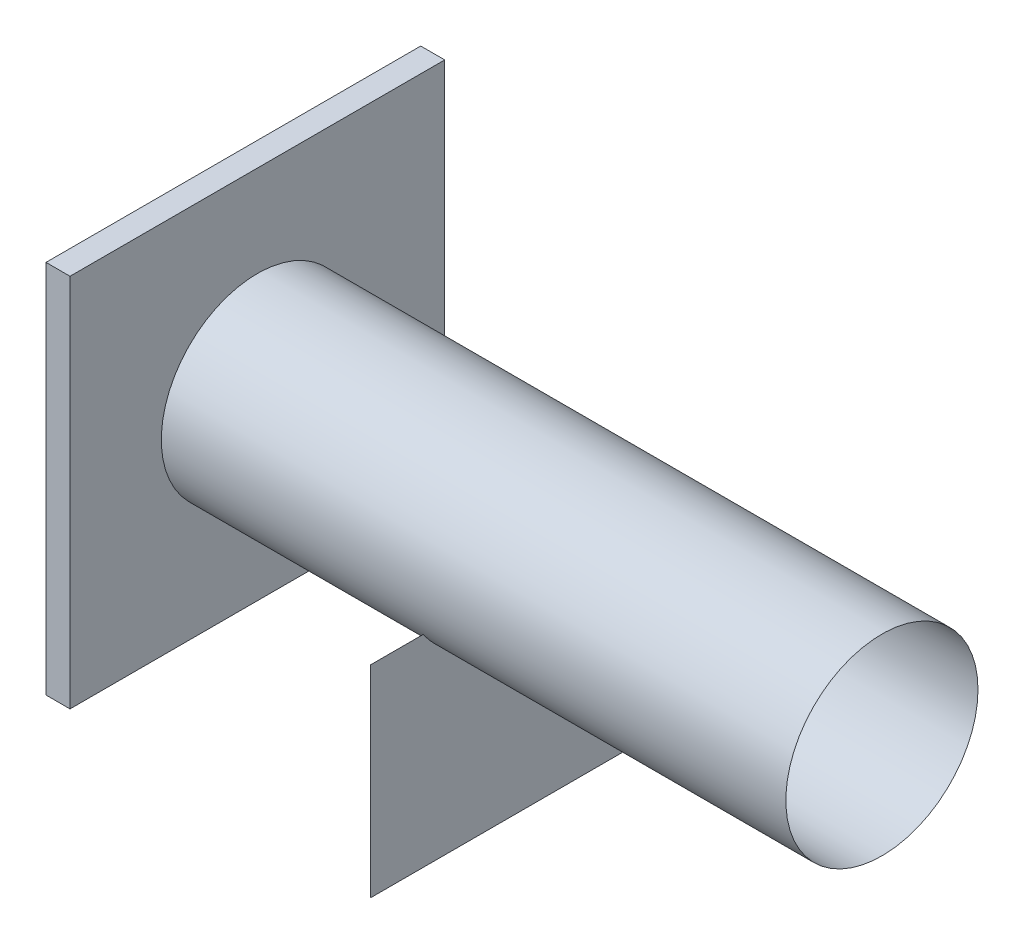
from build123d import *

# Parameters (mm, degrees)
SKETCH4_W           = 780
SKETCH4_H           = 780
SKETCH4_R           = 190
BOSS_EXTRUDE1_DEPTH = 50


with BuildPart() as part:
    # Sketch4 → Boss-Extrude1 (new body)
    with BuildSketch(Plane(origin=(0, 0, 0), x_dir=(0, 0, -1), z_dir=(1, 0, 0))):
        Rectangle(SKETCH4_W, SKETCH4_H)
        Circle(SKETCH4_R, mode=Mode.SUBTRACT)
    extrude(amount=-BOSS_EXTRUDE1_DEPTH)


solid = part.part
